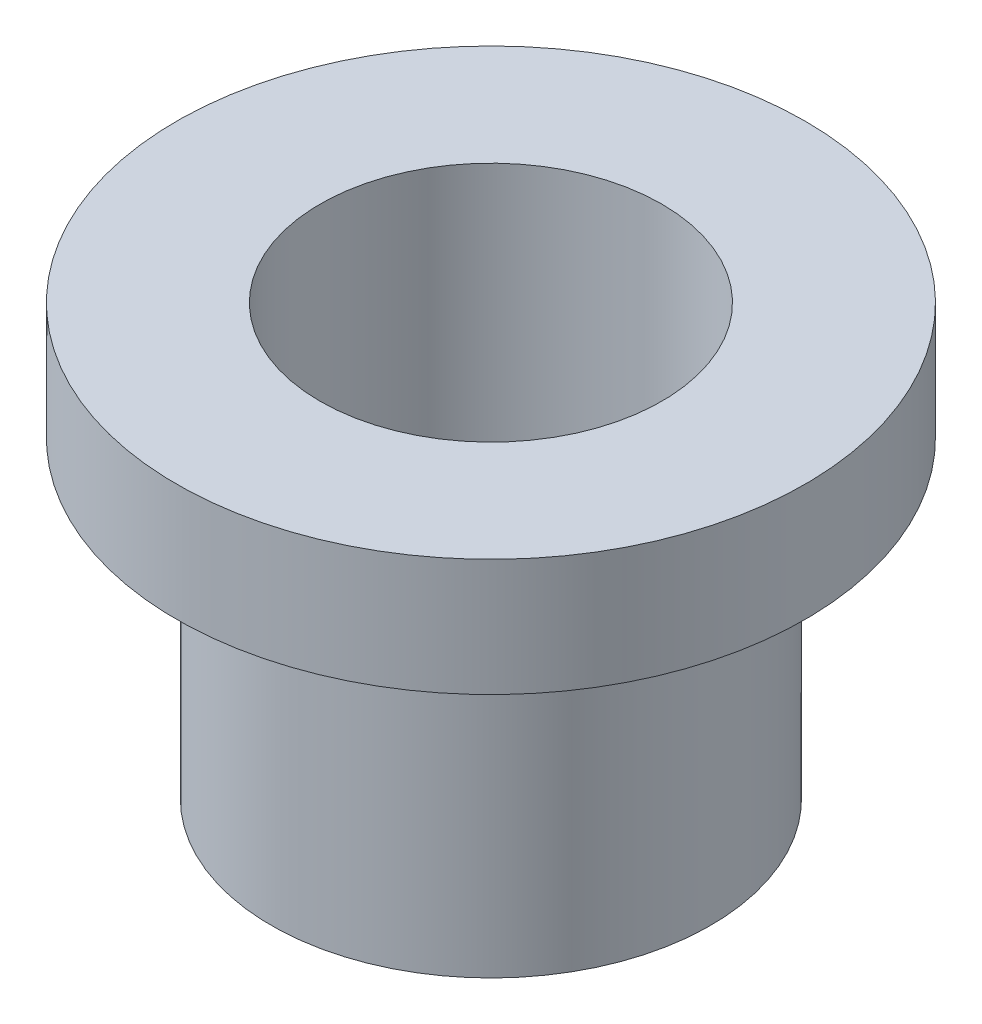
from build123d import *


with BuildPart() as part:
    # Sketch1 → Revolve1 (revolve)
    with BuildSketch(Plane.XY, mode=Mode.PRIVATE) as revolve1_sk:
        Polygon((-5.55625, 3.81), (-10.2235, 3.81), (-10.2235, 0), (-6.35, 0), (-6.35, -2.032), (-7.14375, -2.032), (-7.14375, -10.16), (-5.55625, -10.16), align=None)
    revolve(revolve1_sk.sketch.rotate(Axis((0, 0, 0), (0, 1, 0)), 270), axis=Axis((0, 0, 0), (0, 1, 0)))


solid = part.part
